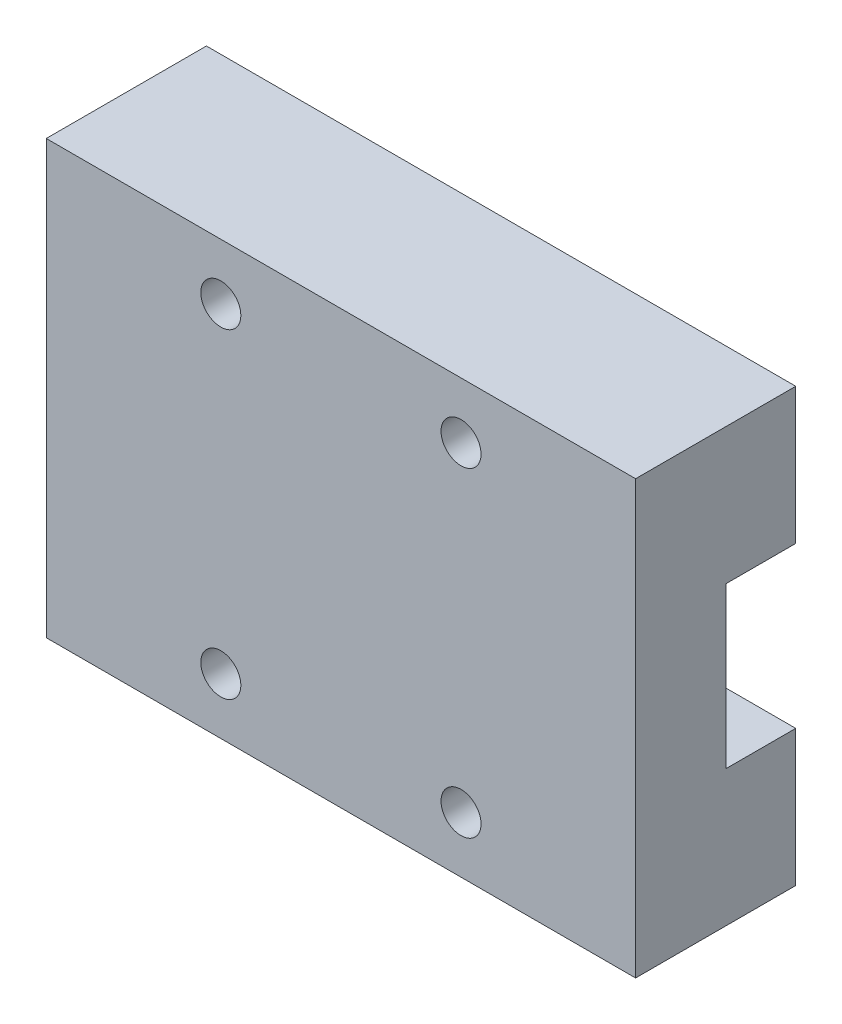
ISO-10303-21;
HEADER;
FILE_DESCRIPTION(('STEP AP214'),'2;1');
FILE_NAME('part.step','',(''),(''),'','','');
FILE_SCHEMA(('AUTOMOTIVE_DESIGN { 1 0 10303 214 1 1 1 1 }'));
ENDSEC;
DATA;
#1=APPLICATION_CONTEXT('core data for automotive mechanical design processes');
#2=APPLICATION_PROTOCOL_DEFINITION('international standard','automotive_design',2000,#1);
#3=PRODUCT_CONTEXT('',#1,'mechanical');
#4=PRODUCT('Part','Part','',(#3));
#5=PRODUCT_RELATED_PRODUCT_CATEGORY('part','',(#4));
#6=PRODUCT_DEFINITION_FORMATION('','',#4);
#7=PRODUCT_DEFINITION_CONTEXT('part definition',#1,'design');
#8=PRODUCT_DEFINITION('design','',#6,#7);
#9=PRODUCT_DEFINITION_SHAPE('','',#8);
#10=(LENGTH_UNIT() NAMED_UNIT(*) SI_UNIT(.MILLI.,.METRE.));
#11=(NAMED_UNIT(*) PLANE_ANGLE_UNIT() SI_UNIT($,.RADIAN.));
#12=(NAMED_UNIT(*) SI_UNIT($,.STERADIAN.) SOLID_ANGLE_UNIT());
#13=UNCERTAINTY_MEASURE_WITH_UNIT(LENGTH_MEASURE(1.E-05),#10,'distance_accuracy_value','');
#14=(GEOMETRIC_REPRESENTATION_CONTEXT(3) GLOBAL_UNCERTAINTY_ASSIGNED_CONTEXT((#13)) GLOBAL_UNIT_ASSIGNED_CONTEXT((#10,
#11,#12)) REPRESENTATION_CONTEXT('',''));
#15=CARTESIAN_POINT('',(0.,0.,0.));
#16=DIRECTION('',(0.,0.,1.));
#17=DIRECTION('',(1.,0.,0.));
#18=AXIS2_PLACEMENT_3D('',#15,#16,#17);
#19=CARTESIAN_POINT('',(0.,0.,0.));
#20=DIRECTION('',(0.,0.,1.));
#21=DIRECTION('',(1.,0.,0.));
#22=AXIS2_PLACEMENT_3D('',#19,#20,#21);
#23=PLANE('',#22);
#24=CARTESIAN_POINT('',(25.9000000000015,23.4999999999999,0.));
#25=DIRECTION('',(0.,0.,1.));
#26=DIRECTION('',(1.,0.,0.));
#27=AXIS2_PLACEMENT_3D('',#24,#25,#26);
#28=CIRCLE('',#27,1.24999999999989);
#29=CARTESIAN_POINT('',(27.1500000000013,23.4999999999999,0.));
#30=VERTEX_POINT('',#29);
#31=EDGE_CURVE('E147',#30,#30,#28,.T.);
#32=ORIENTED_EDGE('',*,*,#31,.T.);
#33=EDGE_LOOP('',(#32));
#34=FACE_BOUND('',#33,.T.);
#35=CARTESIAN_POINT('',(10.9000000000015,23.5,0.));
#36=DIRECTION('',(0.,0.,1.));
#37=DIRECTION('',(1.,0.,0.));
#38=AXIS2_PLACEMENT_3D('',#35,#36,#37);
#39=CIRCLE('',#38,1.25);
#40=CARTESIAN_POINT('',(12.1500000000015,23.5,0.));
#41=VERTEX_POINT('',#40);
#42=EDGE_CURVE('E153',#41,#41,#39,.T.);
#43=ORIENTED_EDGE('',*,*,#42,.T.);
#44=EDGE_LOOP('',(#43));
#45=FACE_BOUND('',#44,.T.);
#46=DIRECTION('',(0.,1.,0.));
#47=VECTOR('',#46,1.);
#48=CARTESIAN_POINT('',(36.8000000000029,27.,0.));
#49=LINE('',#48,#47);
#50=CARTESIAN_POINT('',(36.8000000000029,18.5,0.));
#51=VERTEX_POINT('',#50);
#52=CARTESIAN_POINT('',(36.8000000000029,27.,0.));
#53=VERTEX_POINT('',#52);
#54=EDGE_CURVE('E173',#51,#53,#49,.T.);
#55=ORIENTED_EDGE('',*,*,#54,.F.);
#56=DIRECTION('',(-1.,0.,0.));
#57=VECTOR('',#56,1.);
#58=CARTESIAN_POINT('',(0.,18.5,0.));
#59=LINE('',#58,#57);
#60=CARTESIAN_POINT('',(0.,18.5,0.));
#61=VERTEX_POINT('',#60);
#62=EDGE_CURVE('E134',#51,#61,#59,.T.);
#63=ORIENTED_EDGE('',*,*,#62,.T.);
#64=DIRECTION('',(0.,-1.,0.));
#65=VECTOR('',#64,1.);
#66=CARTESIAN_POINT('',(0.,27.,0.));
#67=LINE('',#66,#65);
#68=CARTESIAN_POINT('',(0.,27.,0.));
#69=VERTEX_POINT('',#68);
#70=EDGE_CURVE('E169',#69,#61,#67,.T.);
#71=ORIENTED_EDGE('',*,*,#70,.F.);
#72=DIRECTION('',(-1.,0.,0.));
#73=VECTOR('',#72,1.);
#74=CARTESIAN_POINT('',(0.,27.,0.));
#75=LINE('',#74,#73);
#76=EDGE_CURVE('E77',#53,#69,#75,.T.);
#77=ORIENTED_EDGE('',*,*,#76,.F.);
#78=EDGE_LOOP('',(#55,#63,#71,#77));
#79=FACE_BOUND('',#78,.T.);
#80=ADVANCED_FACE('F32',(#34,#45,#79),#23,.F.);
#81=CARTESIAN_POINT('',(0.,0.,10.));
#82=DIRECTION('',(0.,0.,1.));
#83=DIRECTION('',(1.,0.,0.));
#84=AXIS2_PLACEMENT_3D('',#81,#82,#83);
#85=PLANE('',#84);
#86=CARTESIAN_POINT('',(10.9000000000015,3.5,10.));
#87=DIRECTION('',(0.,0.,1.));
#88=DIRECTION('',(1.,0.,0.));
#89=AXIS2_PLACEMENT_3D('',#86,#87,#88);
#90=CIRCLE('',#89,1.25);
#91=CARTESIAN_POINT('',(12.1500000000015,3.5,10.));
#92=VERTEX_POINT('',#91);
#93=EDGE_CURVE('E144',#92,#92,#90,.T.);
#94=ORIENTED_EDGE('',*,*,#93,.F.);
#95=EDGE_LOOP('',(#94));
#96=FACE_BOUND('',#95,.T.);
#97=CARTESIAN_POINT('',(10.9000000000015,23.5,10.));
#98=DIRECTION('',(0.,0.,1.));
#99=DIRECTION('',(1.,0.,0.));
#100=AXIS2_PLACEMENT_3D('',#97,#98,#99);
#101=CIRCLE('',#100,1.25);
#102=CARTESIAN_POINT('',(12.1500000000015,23.5,10.));
#103=VERTEX_POINT('',#102);
#104=EDGE_CURVE('E156',#103,#103,#101,.T.);
#105=ORIENTED_EDGE('',*,*,#104,.F.);
#106=EDGE_LOOP('',(#105));
#107=FACE_BOUND('',#106,.T.);
#108=DIRECTION('',(0.,-1.,0.));
#109=VECTOR('',#108,1.);
#110=CARTESIAN_POINT('',(0.,27.,10.));
#111=LINE('',#110,#109);
#112=CARTESIAN_POINT('',(0.,27.,10.));
#113=VERTEX_POINT('',#112);
#114=CARTESIAN_POINT('',(0.,0.,10.));
#115=VERTEX_POINT('',#114);
#116=EDGE_CURVE('E162',#113,#115,#111,.T.);
#117=ORIENTED_EDGE('',*,*,#116,.T.);
#118=DIRECTION('',(1.,0.,0.));
#119=VECTOR('',#118,1.);
#120=CARTESIAN_POINT('',(0.,0.,10.));
#121=LINE('',#120,#119);
#122=CARTESIAN_POINT('',(36.8000000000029,0.,10.));
#123=VERTEX_POINT('',#122);
#124=EDGE_CURVE('E85',#115,#123,#121,.T.);
#125=ORIENTED_EDGE('',*,*,#124,.T.);
#126=DIRECTION('',(0.,1.,0.));
#127=VECTOR('',#126,1.);
#128=CARTESIAN_POINT('',(36.8000000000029,27.,10.));
#129=LINE('',#128,#127);
#130=CARTESIAN_POINT('',(36.8000000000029,27.,10.));
#131=VERTEX_POINT('',#130);
#132=EDGE_CURVE('E165',#123,#131,#129,.T.);
#133=ORIENTED_EDGE('',*,*,#132,.T.);
#134=DIRECTION('',(-1.,0.,0.));
#135=VECTOR('',#134,1.);
#136=CARTESIAN_POINT('',(0.,27.,10.));
#137=LINE('',#136,#135);
#138=EDGE_CURVE('E56',#131,#113,#137,.T.);
#139=ORIENTED_EDGE('',*,*,#138,.T.);
#140=EDGE_LOOP('',(#117,#125,#133,#139));
#141=FACE_BOUND('',#140,.T.);
#142=CARTESIAN_POINT('',(25.9000000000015,23.4999999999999,10.));
#143=DIRECTION('',(0.,0.,1.));
#144=DIRECTION('',(1.,0.,0.));
#145=AXIS2_PLACEMENT_3D('',#142,#143,#144);
#146=CIRCLE('',#145,1.24999999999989);
#147=CARTESIAN_POINT('',(27.1500000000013,23.4999999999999,10.));
#148=VERTEX_POINT('',#147);
#149=EDGE_CURVE('E150',#148,#148,#146,.T.);
#150=ORIENTED_EDGE('',*,*,#149,.F.);
#151=EDGE_LOOP('',(#150));
#152=FACE_BOUND('',#151,.T.);
#153=CARTESIAN_POINT('',(25.9000000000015,3.49999999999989,10.));
#154=DIRECTION('',(0.,0.,1.));
#155=DIRECTION('',(1.,0.,0.));
#156=AXIS2_PLACEMENT_3D('',#153,#154,#155);
#157=CIRCLE('',#156,1.24999999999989);
#158=CARTESIAN_POINT('',(27.1500000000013,3.49999999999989,10.));
#159=VERTEX_POINT('',#158);
#160=EDGE_CURVE('E138',#159,#159,#157,.T.);
#161=ORIENTED_EDGE('',*,*,#160,.F.);
#162=EDGE_LOOP('',(#161));
#163=FACE_BOUND('',#162,.T.);
#164=ADVANCED_FACE('F195',(#96,#107,#141,#152,#163),#85,.T.);
#165=CARTESIAN_POINT('',(10.9000000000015,3.5,0.));
#166=DIRECTION('',(0.,0.,1.));
#167=DIRECTION('',(1.,0.,0.));
#168=AXIS2_PLACEMENT_3D('',#165,#166,#167);
#169=CIRCLE('',#168,1.25);
#170=CARTESIAN_POINT('',(12.1500000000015,3.5,0.));
#171=VERTEX_POINT('',#170);
#172=EDGE_CURVE('E141',#171,#171,#169,.T.);
#173=ORIENTED_EDGE('',*,*,#172,.T.);
#174=EDGE_LOOP('',(#173));
#175=FACE_BOUND('',#174,.T.);
#176=CARTESIAN_POINT('',(0.,8.5,0.));
#177=VERTEX_POINT('',#176);
#178=CARTESIAN_POINT('',(0.,0.,0.));
#179=VERTEX_POINT('',#178);
#180=EDGE_CURVE('E159',#177,#179,#67,.T.);
#181=ORIENTED_EDGE('',*,*,#180,.F.);
#182=DIRECTION('',(1.,0.,0.));
#183=VECTOR('',#182,1.);
#184=CARTESIAN_POINT('',(0.,8.5,0.));
#185=LINE('',#184,#183);
#186=CARTESIAN_POINT('',(36.8000000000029,8.5,0.));
#187=VERTEX_POINT('',#186);
#188=EDGE_CURVE('E121',#177,#187,#185,.T.);
#189=ORIENTED_EDGE('',*,*,#188,.T.);
#190=CARTESIAN_POINT('',(36.8000000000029,0.,0.));
#191=VERTEX_POINT('',#190);
#192=EDGE_CURVE('E174',#191,#187,#49,.T.);
#193=ORIENTED_EDGE('',*,*,#192,.F.);
#194=DIRECTION('',(1.,0.,0.));
#195=VECTOR('',#194,1.);
#196=CARTESIAN_POINT('',(0.,0.,0.));
#197=LINE('',#196,#195);
#198=EDGE_CURVE('E171',#179,#191,#197,.T.);
#199=ORIENTED_EDGE('',*,*,#198,.F.);
#200=EDGE_LOOP('',(#181,#189,#193,#199));
#201=FACE_BOUND('',#200,.T.);
#202=CARTESIAN_POINT('',(25.9000000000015,3.49999999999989,0.));
#203=DIRECTION('',(0.,0.,1.));
#204=DIRECTION('',(1.,0.,0.));
#205=AXIS2_PLACEMENT_3D('',#202,#203,#204);
#206=CIRCLE('',#205,1.24999999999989);
#207=CARTESIAN_POINT('',(27.1500000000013,3.49999999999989,0.));
#208=VERTEX_POINT('',#207);
#209=EDGE_CURVE('E137',#208,#208,#206,.T.);
#210=ORIENTED_EDGE('',*,*,#209,.T.);
#211=EDGE_LOOP('',(#210));
#212=FACE_BOUND('',#211,.T.);
#213=ADVANCED_FACE('F189',(#175,#201,#212),#23,.F.);
#214=CARTESIAN_POINT('',(0.,27.,10.));
#215=DIRECTION('',(1.,0.,0.));
#216=DIRECTION('',(0.,0.,-1.));
#217=AXIS2_PLACEMENT_3D('',#214,#215,#216);
#218=PLANE('',#217);
#219=ORIENTED_EDGE('',*,*,#70,.T.);
#220=DIRECTION('',(0.,0.,1.));
#221=VECTOR('',#220,1.);
#222=CARTESIAN_POINT('',(0.,18.5,4.35));
#223=LINE('',#222,#221);
#224=CARTESIAN_POINT('',(0.,18.5,4.35));
#225=VERTEX_POINT('',#224);
#226=EDGE_CURVE('E115',#61,#225,#223,.T.);
#227=ORIENTED_EDGE('',*,*,#226,.T.);
#228=DIRECTION('',(0.,-1.,0.));
#229=VECTOR('',#228,1.);
#230=CARTESIAN_POINT('',(0.,18.5,4.35));
#231=LINE('',#230,#229);
#232=CARTESIAN_POINT('',(0.,8.5,4.35));
#233=VERTEX_POINT('',#232);
#234=EDGE_CURVE('E110',#225,#233,#231,.T.);
#235=ORIENTED_EDGE('',*,*,#234,.T.);
#236=DIRECTION('',(0.,0.,-1.));
#237=VECTOR('',#236,1.);
#238=CARTESIAN_POINT('',(0.,8.5,4.35));
#239=LINE('',#238,#237);
#240=EDGE_CURVE('E118',#233,#177,#239,.T.);
#241=ORIENTED_EDGE('',*,*,#240,.T.);
#242=ORIENTED_EDGE('',*,*,#180,.T.);
#243=DIRECTION('',(0.,0.,-1.));
#244=VECTOR('',#243,1.);
#245=CARTESIAN_POINT('',(0.,0.,10.));
#246=LINE('',#245,#244);
#247=EDGE_CURVE('E40',#115,#179,#246,.T.);
#248=ORIENTED_EDGE('',*,*,#247,.F.);
#249=ORIENTED_EDGE('',*,*,#116,.F.);
#250=DIRECTION('',(0.,0.,-1.));
#251=VECTOR('',#250,1.);
#252=CARTESIAN_POINT('',(0.,27.,10.));
#253=LINE('',#252,#251);
#254=EDGE_CURVE('E168',#113,#69,#253,.T.);
#255=ORIENTED_EDGE('',*,*,#254,.T.);
#256=EDGE_LOOP('',(#219,#227,#235,#241,#242,#248,#249,#255));
#257=FACE_BOUND('',#256,.T.);
#258=ADVANCED_FACE('F34',(#257),#218,.F.);
#259=CARTESIAN_POINT('',(0.,0.,10.));
#260=DIRECTION('',(0.,1.,0.));
#261=DIRECTION('',(0.,0.,1.));
#262=AXIS2_PLACEMENT_3D('',#259,#260,#261);
#263=PLANE('',#262);
#264=ORIENTED_EDGE('',*,*,#198,.T.);
#265=DIRECTION('',(0.,0.,-1.));
#266=VECTOR('',#265,1.);
#267=CARTESIAN_POINT('',(36.8000000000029,0.,10.));
#268=LINE('',#267,#266);
#269=EDGE_CURVE('E181',#123,#191,#268,.T.);
#270=ORIENTED_EDGE('',*,*,#269,.F.);
#271=ORIENTED_EDGE('',*,*,#124,.F.);
#272=ORIENTED_EDGE('',*,*,#247,.T.);
#273=EDGE_LOOP('',(#264,#270,#271,#272));
#274=FACE_BOUND('',#273,.T.);
#275=ADVANCED_FACE('F184',(#274),#263,.F.);
#276=CARTESIAN_POINT('',(36.8000000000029,27.,10.));
#277=DIRECTION('',(-1.,0.,0.));
#278=DIRECTION('',(0.,0.,1.));
#279=AXIS2_PLACEMENT_3D('',#276,#277,#278);
#280=PLANE('',#279);
#281=DIRECTION('',(0.,-1.,0.));
#282=VECTOR('',#281,1.);
#283=CARTESIAN_POINT('',(36.8000000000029,18.5,4.35));
#284=LINE('',#283,#282);
#285=CARTESIAN_POINT('',(36.8000000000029,18.5,4.35));
#286=VERTEX_POINT('',#285);
#287=CARTESIAN_POINT('',(36.8000000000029,8.5,4.35));
#288=VERTEX_POINT('',#287);
#289=EDGE_CURVE('E47',#286,#288,#284,.T.);
#290=ORIENTED_EDGE('',*,*,#289,.F.);
#291=DIRECTION('',(0.,0.,-1.));
#292=VECTOR('',#291,1.);
#293=CARTESIAN_POINT('',(36.8000000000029,18.5,10.));
#294=LINE('',#293,#292);
#295=EDGE_CURVE('E11',#286,#51,#294,.T.);
#296=ORIENTED_EDGE('',*,*,#295,.T.);
#297=ORIENTED_EDGE('',*,*,#54,.T.);
#298=DIRECTION('',(0.,0.,-1.));
#299=VECTOR('',#298,1.);
#300=CARTESIAN_POINT('',(36.8000000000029,27.,10.));
#301=LINE('',#300,#299);
#302=EDGE_CURVE('E179',#131,#53,#301,.T.);
#303=ORIENTED_EDGE('',*,*,#302,.F.);
#304=ORIENTED_EDGE('',*,*,#132,.F.);
#305=ORIENTED_EDGE('',*,*,#269,.T.);
#306=ORIENTED_EDGE('',*,*,#192,.T.);
#307=DIRECTION('',(0.,0.,-1.));
#308=VECTOR('',#307,1.);
#309=CARTESIAN_POINT('',(36.8000000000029,8.5,4.35));
#310=LINE('',#309,#308);
#311=EDGE_CURVE('E126',#288,#187,#310,.T.);
#312=ORIENTED_EDGE('',*,*,#311,.F.);
#313=EDGE_LOOP('',(#290,#296,#297,#303,#304,#305,#306,#312));
#314=FACE_BOUND('',#313,.T.);
#315=ADVANCED_FACE('F192',(#314),#280,.F.);
#316=CARTESIAN_POINT('',(0.,27.,10.));
#317=DIRECTION('',(0.,-1.,0.));
#318=DIRECTION('',(0.,0.,-1.));
#319=AXIS2_PLACEMENT_3D('',#316,#317,#318);
#320=PLANE('',#319);
#321=ORIENTED_EDGE('',*,*,#76,.T.);
#322=ORIENTED_EDGE('',*,*,#254,.F.);
#323=ORIENTED_EDGE('',*,*,#138,.F.);
#324=ORIENTED_EDGE('',*,*,#302,.T.);
#325=EDGE_LOOP('',(#321,#322,#323,#324));
#326=FACE_BOUND('',#325,.T.);
#327=ADVANCED_FACE('F228',(#326),#320,.F.);
#328=CARTESIAN_POINT('',(10.9000000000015,23.5,10.));
#329=DIRECTION('',(0.,0.,-1.));
#330=DIRECTION('',(-1.,0.,0.));
#331=AXIS2_PLACEMENT_3D('',#328,#329,#330);
#332=CYLINDRICAL_SURFACE('',#331,1.25);
#333=ORIENTED_EDGE('',*,*,#104,.T.);
#334=EDGE_LOOP('',(#333));
#335=FACE_BOUND('',#334,.T.);
#336=ORIENTED_EDGE('',*,*,#42,.F.);
#337=EDGE_LOOP('',(#336));
#338=FACE_BOUND('',#337,.T.);
#339=ADVANCED_FACE('F230',(#335,#338),#332,.F.);
#340=CARTESIAN_POINT('',(25.9000000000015,23.4999999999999,10.));
#341=DIRECTION('',(0.,0.,-1.));
#342=DIRECTION('',(-1.,0.,0.));
#343=AXIS2_PLACEMENT_3D('',#340,#341,#342);
#344=CYLINDRICAL_SURFACE('',#343,1.24999999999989);
#345=ORIENTED_EDGE('',*,*,#149,.T.);
#346=EDGE_LOOP('',(#345));
#347=FACE_BOUND('',#346,.T.);
#348=ORIENTED_EDGE('',*,*,#31,.F.);
#349=EDGE_LOOP('',(#348));
#350=FACE_BOUND('',#349,.T.);
#351=ADVANCED_FACE('F235',(#347,#350),#344,.F.);
#352=CARTESIAN_POINT('',(10.9000000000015,3.5,10.));
#353=DIRECTION('',(0.,0.,-1.));
#354=DIRECTION('',(-1.,0.,0.));
#355=AXIS2_PLACEMENT_3D('',#352,#353,#354);
#356=CYLINDRICAL_SURFACE('',#355,1.25);
#357=ORIENTED_EDGE('',*,*,#93,.T.);
#358=EDGE_LOOP('',(#357));
#359=FACE_BOUND('',#358,.T.);
#360=ORIENTED_EDGE('',*,*,#172,.F.);
#361=EDGE_LOOP('',(#360));
#362=FACE_BOUND('',#361,.T.);
#363=ADVANCED_FACE('F208',(#359,#362),#356,.F.);
#364=CARTESIAN_POINT('',(25.9000000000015,3.49999999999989,10.));
#365=DIRECTION('',(0.,0.,-1.));
#366=DIRECTION('',(-1.,0.,0.));
#367=AXIS2_PLACEMENT_3D('',#364,#365,#366);
#368=CYLINDRICAL_SURFACE('',#367,1.24999999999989);
#369=ORIENTED_EDGE('',*,*,#160,.T.);
#370=EDGE_LOOP('',(#369));
#371=FACE_BOUND('',#370,.T.);
#372=ORIENTED_EDGE('',*,*,#209,.F.);
#373=EDGE_LOOP('',(#372));
#374=FACE_BOUND('',#373,.T.);
#375=ADVANCED_FACE('F204',(#371,#374),#368,.F.);
#376=CARTESIAN_POINT('',(0.,18.5,4.35));
#377=DIRECTION('',(0.,1.,0.));
#378=DIRECTION('',(0.,0.,1.));
#379=AXIS2_PLACEMENT_3D('',#376,#377,#378);
#380=PLANE('',#379);
#381=ORIENTED_EDGE('',*,*,#295,.F.);
#382=DIRECTION('',(1.,0.,0.));
#383=VECTOR('',#382,1.);
#384=CARTESIAN_POINT('',(0.,18.5,4.35));
#385=LINE('',#384,#383);
#386=EDGE_CURVE('E114',#225,#286,#385,.T.);
#387=ORIENTED_EDGE('',*,*,#386,.F.);
#388=ORIENTED_EDGE('',*,*,#226,.F.);
#389=ORIENTED_EDGE('',*,*,#62,.F.);
#390=EDGE_LOOP('',(#381,#387,#388,#389));
#391=FACE_BOUND('',#390,.T.);
#392=ADVANCED_FACE('F207',(#391),#380,.F.);
#393=CARTESIAN_POINT('',(0.,8.5,4.35));
#394=DIRECTION('',(0.,-1.,0.));
#395=DIRECTION('',(0.,0.,-1.));
#396=AXIS2_PLACEMENT_3D('',#393,#394,#395);
#397=PLANE('',#396);
#398=ORIENTED_EDGE('',*,*,#240,.F.);
#399=DIRECTION('',(1.,0.,0.));
#400=VECTOR('',#399,1.);
#401=CARTESIAN_POINT('',(0.,8.5,4.35));
#402=LINE('',#401,#400);
#403=EDGE_CURVE('E106',#233,#288,#402,.T.);
#404=ORIENTED_EDGE('',*,*,#403,.T.);
#405=ORIENTED_EDGE('',*,*,#311,.T.);
#406=ORIENTED_EDGE('',*,*,#188,.F.);
#407=EDGE_LOOP('',(#398,#404,#405,#406));
#408=FACE_BOUND('',#407,.T.);
#409=ADVANCED_FACE('F119',(#408),#397,.F.);
#410=CARTESIAN_POINT('',(0.,18.5,4.35));
#411=DIRECTION('',(0.,0.,1.));
#412=DIRECTION('',(1.,0.,0.));
#413=AXIS2_PLACEMENT_3D('',#410,#411,#412);
#414=PLANE('',#413);
#415=ORIENTED_EDGE('',*,*,#289,.T.);
#416=ORIENTED_EDGE('',*,*,#403,.F.);
#417=ORIENTED_EDGE('',*,*,#234,.F.);
#418=ORIENTED_EDGE('',*,*,#386,.T.);
#419=EDGE_LOOP('',(#415,#416,#417,#418));
#420=FACE_BOUND('',#419,.T.);
#421=ADVANCED_FACE('F108',(#420),#414,.F.);
#422=CLOSED_SHELL('',(#80,#164,#213,#258,#275,#315,#327,#339,#351,#363,#375,#392,#409,#421));
#423=MANIFOLD_SOLID_BREP('B2',#422);
#424=ADVANCED_BREP_SHAPE_REPRESENTATION('',(#18,#423),#14);
#425=SHAPE_DEFINITION_REPRESENTATION(#9,#424);
ENDSEC;
END-ISO-10303-21;
